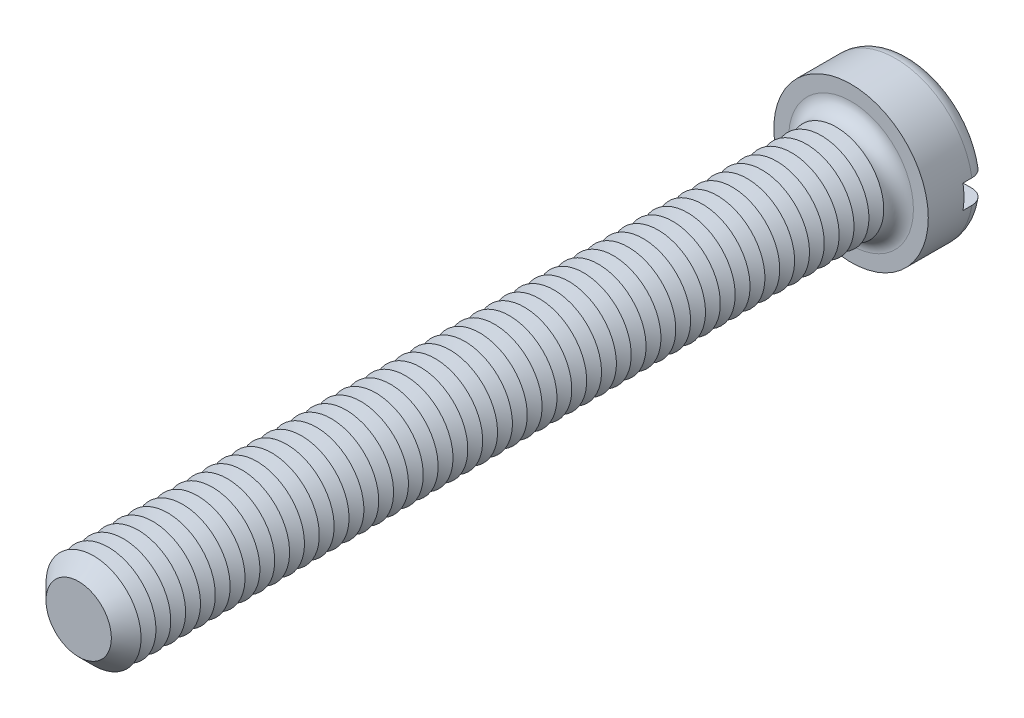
from build123d import *

# Parameters (mm, degrees)
SKETCH3_R           = 6.5
BOSS_EXTRUDE2_DEPTH = 5
SKETCH4_R           = 4
BOSS_EXTRUDE3_DEPTH = 65
FILLET1_R           = 1.25
CHAMFER1_SIZE       = 1.25
LPATTERN1_COUNT     = 50
LPATTERN1_PITCH     = 1.25
SKETCH8_W           = 13
SKETCH8_H           = 2
CUT_EXTRUDE1_DEPTH  = 2


with BuildPart() as part:
    # Sketch3 → Boss-Extrude2 (new body)
    with BuildSketch(Plane.XY):
        Circle(SKETCH3_R)
    extrude(amount=-BOSS_EXTRUDE2_DEPTH)

    # Sketch4 → Boss-Extrude3 (add)
    with BuildSketch(Plane.XY):
        Circle(SKETCH4_R)
    extrude(amount=BOSS_EXTRUDE3_DEPTH)

    # Fillet1
    fillet1_edges = [part.edges().sort_by_distance(p)[0] for p in [
        (-6.5, 0, -5),
        (-4, 0, 0),
    ]]
    fillet(fillet1_edges, radius=FILLET1_R)

    # Chamfer1
    chamfer1_edges = [part.edges().sort_by_distance(p)[0] for p in [
        (-4, 0, 65),
    ]]
    chamfer(chamfer1_edges, length=CHAMFER1_SIZE)

    # Sketch6 → Cut-Revolve1 (revolve, cut)
    with BuildSketch(Plane(origin=(0, 0, 0), x_dir=(0, 0, -1), z_dir=(1, 0, 0)), mode=Mode.PRIVATE) as cut_revolve1_sk:
        Polygon((-1.25, 4), (-1.875, 2.917468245), (-2.5, 4), align=None)
    cut_revolve1 = revolve(cut_revolve1_sk.sketch.rotate(Axis((0, 0, -1.694361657), (0, 0, 1)), 90), axis=Axis((0, 0, -1.694361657), (0, 0, 1)), mode=Mode.SUBTRACT)

    # LPattern1: Cut-Revolve1 ×50
    with Locations(*[(0, 0, i * LPATTERN1_PITCH) for i in range(1, LPATTERN1_COUNT)]):
        add(cut_revolve1, mode=Mode.SUBTRACT)

    # Sketch8 → Cut-Extrude1 (cut)
    with BuildSketch(Plane(origin=(0, 0, -5), x_dir=(-1, 0, 0), z_dir=(0, 0, -1))):
        Rectangle(SKETCH8_W, SKETCH8_H)
    extrude(amount=-CUT_EXTRUDE1_DEPTH, mode=Mode.SUBTRACT)


solid = part.part
